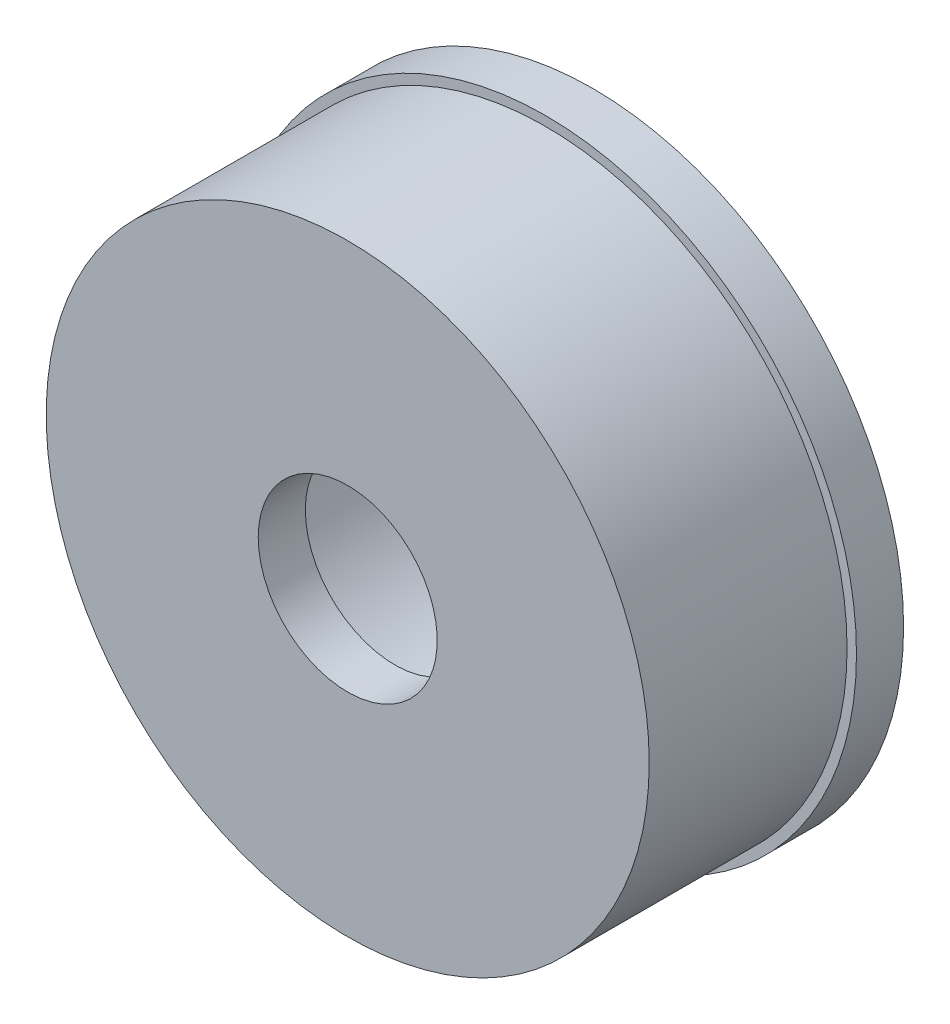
ISO-10303-21;
HEADER;
FILE_DESCRIPTION(('STEP AP214'),'2;1');
FILE_NAME('part.step','',(''),(''),'','','');
FILE_SCHEMA(('AUTOMOTIVE_DESIGN { 1 0 10303 214 1 1 1 1 }'));
ENDSEC;
DATA;
#1=APPLICATION_CONTEXT('core data for automotive mechanical design processes');
#2=APPLICATION_PROTOCOL_DEFINITION('international standard','automotive_design',2000,#1);
#3=PRODUCT_CONTEXT('',#1,'mechanical');
#4=PRODUCT('Part','Part','',(#3));
#5=PRODUCT_RELATED_PRODUCT_CATEGORY('part','',(#4));
#6=PRODUCT_DEFINITION_FORMATION('','',#4);
#7=PRODUCT_DEFINITION_CONTEXT('part definition',#1,'design');
#8=PRODUCT_DEFINITION('design','',#6,#7);
#9=PRODUCT_DEFINITION_SHAPE('','',#8);
#10=(LENGTH_UNIT() NAMED_UNIT(*) SI_UNIT(.MILLI.,.METRE.));
#11=(NAMED_UNIT(*) PLANE_ANGLE_UNIT() SI_UNIT($,.RADIAN.));
#12=(NAMED_UNIT(*) SI_UNIT($,.STERADIAN.) SOLID_ANGLE_UNIT());
#13=UNCERTAINTY_MEASURE_WITH_UNIT(LENGTH_MEASURE(1.E-05),#10,'distance_accuracy_value','');
#14=(GEOMETRIC_REPRESENTATION_CONTEXT(3) GLOBAL_UNCERTAINTY_ASSIGNED_CONTEXT((#13)) GLOBAL_UNIT_ASSIGNED_CONTEXT((#10,
#11,#12)) REPRESENTATION_CONTEXT('',''));
#15=CARTESIAN_POINT('',(0.,0.,0.));
#16=DIRECTION('',(0.,0.,1.));
#17=DIRECTION('',(1.,0.,0.));
#18=AXIS2_PLACEMENT_3D('',#15,#16,#17);
#19=CARTESIAN_POINT('',(0.,0.,26.));
#20=DIRECTION('',(0.,0.,-1.));
#21=DIRECTION('',(-1.,0.,0.));
#22=AXIS2_PLACEMENT_3D('',#19,#20,#21);
#23=CYLINDRICAL_SURFACE('',#22,33.);
#24=CARTESIAN_POINT('',(0.,0.,0.));
#25=DIRECTION('',(0.,0.,1.));
#26=DIRECTION('',(1.,0.,0.));
#27=AXIS2_PLACEMENT_3D('',#24,#25,#26);
#28=CIRCLE('',#27,33.);
#29=CARTESIAN_POINT('',(-33.,0.,0.));
#30=VERTEX_POINT('',#29);
#31=EDGE_CURVE('E11',#30,#30,#28,.T.);
#32=CARTESIAN_POINT('',(0.,0.,5.));
#33=DIRECTION('',(0.,0.,1.));
#34=DIRECTION('',(1.,0.,0.));
#35=AXIS2_PLACEMENT_3D('',#32,#33,#34);
#36=CIRCLE('',#35,33.);
#37=CARTESIAN_POINT('',(-33.,0.,5.));
#38=VERTEX_POINT('',#37);
#39=EDGE_CURVE('E38',#38,#38,#36,.T.);
#40=CARTESIAN_POINT('',(-33.,0.,0.));
#41=CARTESIAN_POINT('',(-33.,0.,0.0520833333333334));
#42=CARTESIAN_POINT('',(-33.,0.,0.104166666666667));
#43=CARTESIAN_POINT('',(-33.,0.,0.208333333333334));
#44=CARTESIAN_POINT('',(-33.,0.,0.260416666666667));
#45=CARTESIAN_POINT('',(-33.,0.,0.364583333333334));
#46=CARTESIAN_POINT('',(-33.,0.,0.416666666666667));
#47=CARTESIAN_POINT('',(-33.,0.,0.520833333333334));
#48=CARTESIAN_POINT('',(-33.,0.,0.572916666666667));
#49=CARTESIAN_POINT('',(-33.,0.,0.677083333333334));
#50=CARTESIAN_POINT('',(-33.,0.,0.729166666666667));
#51=CARTESIAN_POINT('',(-33.,0.,0.833333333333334));
#52=CARTESIAN_POINT('',(-33.,0.,0.885416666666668));
#53=CARTESIAN_POINT('',(-33.,0.,0.989583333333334));
#54=CARTESIAN_POINT('',(-33.,0.,1.04166666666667));
#55=CARTESIAN_POINT('',(-33.,0.,1.14583333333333));
#56=CARTESIAN_POINT('',(-33.,0.,1.19791666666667));
#57=CARTESIAN_POINT('',(-33.,0.,1.30208333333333));
#58=CARTESIAN_POINT('',(-33.,0.,1.35416666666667));
#59=CARTESIAN_POINT('',(-33.,0.,1.45833333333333));
#60=CARTESIAN_POINT('',(-33.,0.,1.51041666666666));
#61=CARTESIAN_POINT('',(-33.,0.,1.61458333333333));
#62=CARTESIAN_POINT('',(-33.,0.,1.66666666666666));
#63=CARTESIAN_POINT('',(-33.,0.,1.77083333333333));
#64=CARTESIAN_POINT('',(-33.,0.,1.82291666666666));
#65=CARTESIAN_POINT('',(-33.,0.,1.92708333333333));
#66=CARTESIAN_POINT('',(-33.,0.,1.97916666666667));
#67=CARTESIAN_POINT('',(-33.,0.,2.08333333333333));
#68=CARTESIAN_POINT('',(-33.,0.,2.13541666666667));
#69=CARTESIAN_POINT('',(-33.,0.,2.23958333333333));
#70=CARTESIAN_POINT('',(-33.,0.,2.29166666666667));
#71=CARTESIAN_POINT('',(-33.,0.,2.39583333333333));
#72=CARTESIAN_POINT('',(-33.,0.,2.44791666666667));
#73=CARTESIAN_POINT('',(-33.,0.,2.55208333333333));
#74=CARTESIAN_POINT('',(-33.,0.,2.60416666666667));
#75=CARTESIAN_POINT('',(-33.,0.,2.70833333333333));
#76=CARTESIAN_POINT('',(-33.,0.,2.76041666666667));
#77=CARTESIAN_POINT('',(-33.,0.,2.86458333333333));
#78=CARTESIAN_POINT('',(-33.,0.,2.91666666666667));
#79=CARTESIAN_POINT('',(-33.,0.,3.02083333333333));
#80=CARTESIAN_POINT('',(-33.,0.,3.07291666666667));
#81=CARTESIAN_POINT('',(-33.,0.,3.17708333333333));
#82=CARTESIAN_POINT('',(-33.,0.,3.22916666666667));
#83=CARTESIAN_POINT('',(-33.,0.,3.33333333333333));
#84=CARTESIAN_POINT('',(-33.,0.,3.38541666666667));
#85=CARTESIAN_POINT('',(-33.,0.,3.48958333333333));
#86=CARTESIAN_POINT('',(-33.,0.,3.54166666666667));
#87=CARTESIAN_POINT('',(-33.,0.,3.64583333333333));
#88=CARTESIAN_POINT('',(-33.,0.,3.69791666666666));
#89=CARTESIAN_POINT('',(-33.,0.,3.80208333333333));
#90=CARTESIAN_POINT('',(-33.,0.,3.85416666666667));
#91=CARTESIAN_POINT('',(-33.,0.,3.95833333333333));
#92=CARTESIAN_POINT('',(-33.,0.,4.01041666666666));
#93=CARTESIAN_POINT('',(-33.,0.,4.11458333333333));
#94=CARTESIAN_POINT('',(-33.,0.,4.16666666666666));
#95=CARTESIAN_POINT('',(-33.,0.,4.27083333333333));
#96=CARTESIAN_POINT('',(-33.,0.,4.32291666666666));
#97=CARTESIAN_POINT('',(-33.,0.,4.42708333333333));
#98=CARTESIAN_POINT('',(-33.,0.,4.47916666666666));
#99=CARTESIAN_POINT('',(-33.,0.,4.58333333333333));
#100=CARTESIAN_POINT('',(-33.,0.,4.63541666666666));
#101=CARTESIAN_POINT('',(-33.,0.,4.73958333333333));
#102=CARTESIAN_POINT('',(-33.,0.,4.79166666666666));
#103=CARTESIAN_POINT('',(-33.,0.,4.89583333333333));
#104=CARTESIAN_POINT('',(-33.,0.,4.94791666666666));
#105=CARTESIAN_POINT('',(-33.,0.,5.));
#106=B_SPLINE_CURVE_WITH_KNOTS('',3,(#40,#41,#42,#43,#44,#45,#46,#47,#48,#49,#50,#51,#52,#53,
#54,#55,#56,#57,#58,#59,#60,#61,#62,#63,#64,#65,#66,#67,#68,#69,#70,#71,#72,#73,#74,#75,#76,#77,
#78,#79,#80,#81,#82,#83,#84,#85,#86,#87,#88,#89,#90,#91,#92,#93,#94,#95,#96,#97,#98,#99,#100,
#101,#102,#103,#104,#105),.UNSPECIFIED.,.F.,.F.,(4,2,2,2,2,2,2,2,2,2,2,2,2,2,2,2,2,2,2,2,2,2,2,
2,2,2,2,2,2,2,2,2,4),(0.,0.15625,0.3125,0.46875,0.625000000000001,0.781250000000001,
0.937500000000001,1.09375,1.25,1.40625,1.5625,1.71875,1.875,2.03125,2.1875,2.34375,2.5,2.65625,
2.8125,2.96875,3.125,3.28125,3.4375,3.59375,3.75,3.90625,4.0625,4.21875,4.375,4.53125,4.6875,
4.84375,5.),.UNSPECIFIED.);
#107=EDGE_CURVE('BSEAM31',#30,#38,#106,.T.);
#108=ORIENTED_EDGE('',*,*,#31,.T.);
#109=ORIENTED_EDGE('',*,*,#39,.F.);
#110=ORIENTED_EDGE('',*,*,#107,.T.);
#111=ORIENTED_EDGE('',*,*,#107,.F.);
#112=EDGE_LOOP('',(#108,#110,#109,#111));
#113=FACE_BOUND('',#112,.T.);
#114=ADVANCED_FACE('F31',(#113),#23,.T.);
#115=CARTESIAN_POINT('',(0.,0.,0.));
#116=DIRECTION('',(0.,0.,1.));
#117=DIRECTION('',(1.,0.,0.));
#118=AXIS2_PLACEMENT_3D('',#115,#116,#117);
#119=PLANE('',#118);
#120=CARTESIAN_POINT('',(0.,0.,0.));
#121=DIRECTION('',(0.,0.,-1.));
#122=DIRECTION('',(-1.,0.,0.));
#123=AXIS2_PLACEMENT_3D('',#120,#121,#122);
#124=CIRCLE('',#123,24.5);
#125=CARTESIAN_POINT('',(-24.5,0.,0.));
#126=VERTEX_POINT('',#125);
#127=EDGE_CURVE('E110',#126,#126,#124,.T.);
#128=ORIENTED_EDGE('',*,*,#127,.F.);
#129=EDGE_LOOP('',(#128));
#130=FACE_BOUND('',#129,.T.);
#131=ORIENTED_EDGE('',*,*,#31,.F.);
#132=EDGE_LOOP('',(#131));
#133=FACE_BOUND('',#132,.T.);
#134=ADVANCED_FACE('F127',(#130,#133),#119,.F.);
#135=CARTESIAN_POINT('',(0.,0.,5.));
#136=DIRECTION('',(0.,0.,1.));
#137=DIRECTION('',(1.,0.,0.));
#138=AXIS2_PLACEMENT_3D('',#135,#136,#137);
#139=PLANE('',#138);
#140=CARTESIAN_POINT('',(0.,0.,5.));
#141=DIRECTION('',(0.,0.,1.));
#142=DIRECTION('',(1.,0.,0.));
#143=AXIS2_PLACEMENT_3D('',#140,#141,#142);
#144=CIRCLE('',#143,32.);
#145=CARTESIAN_POINT('',(32.,0.,5.));
#146=VERTEX_POINT('',#145);
#147=EDGE_CURVE('E119',#146,#146,#144,.T.);
#148=ORIENTED_EDGE('',*,*,#147,.F.);
#149=EDGE_LOOP('',(#148));
#150=FACE_BOUND('',#149,.T.);
#151=ORIENTED_EDGE('',*,*,#39,.T.);
#152=EDGE_LOOP('',(#151));
#153=FACE_BOUND('',#152,.T.);
#154=ADVANCED_FACE('F124',(#150,#153),#139,.T.);
#155=CARTESIAN_POINT('',(0.,0.,5.));
#156=DIRECTION('',(0.,0.,1.));
#157=DIRECTION('',(1.,0.,0.));
#158=AXIS2_PLACEMENT_3D('',#155,#156,#157);
#159=CYLINDRICAL_SURFACE('',#158,32.);
#160=CARTESIAN_POINT('',(0.,0.,26.));
#161=DIRECTION('',(0.,0.,1.));
#162=DIRECTION('',(1.,0.,0.));
#163=AXIS2_PLACEMENT_3D('',#160,#161,#162);
#164=CIRCLE('',#163,32.);
#165=CARTESIAN_POINT('',(32.,0.,26.));
#166=VERTEX_POINT('',#165);
#167=EDGE_CURVE('E116',#166,#166,#164,.T.);
#168=CARTESIAN_POINT('',(32.,0.,5.));
#169=CARTESIAN_POINT('',(32.,0.,5.21875));
#170=CARTESIAN_POINT('',(32.,0.,5.4375));
#171=CARTESIAN_POINT('',(32.,0.,5.875));
#172=CARTESIAN_POINT('',(32.,0.,6.09375));
#173=CARTESIAN_POINT('',(32.,0.,6.53125));
#174=CARTESIAN_POINT('',(32.,0.,6.75));
#175=CARTESIAN_POINT('',(32.,0.,7.1875));
#176=CARTESIAN_POINT('',(32.,0.,7.40625));
#177=CARTESIAN_POINT('',(32.,0.,7.84375));
#178=CARTESIAN_POINT('',(32.,0.,8.0625));
#179=CARTESIAN_POINT('',(32.,0.,8.5));
#180=CARTESIAN_POINT('',(32.,0.,8.71875));
#181=CARTESIAN_POINT('',(32.,0.,9.15625));
#182=CARTESIAN_POINT('',(32.,0.,9.375));
#183=CARTESIAN_POINT('',(32.,0.,9.8125));
#184=CARTESIAN_POINT('',(32.,0.,10.03125));
#185=CARTESIAN_POINT('',(32.,0.,10.46875));
#186=CARTESIAN_POINT('',(32.,0.,10.6875));
#187=CARTESIAN_POINT('',(32.,0.,11.125));
#188=CARTESIAN_POINT('',(32.,0.,11.34375));
#189=CARTESIAN_POINT('',(32.,0.,11.78125));
#190=CARTESIAN_POINT('',(32.,0.,12.));
#191=CARTESIAN_POINT('',(32.,0.,12.4375));
#192=CARTESIAN_POINT('',(32.,0.,12.65625));
#193=CARTESIAN_POINT('',(32.,0.,13.09375));
#194=CARTESIAN_POINT('',(32.,0.,13.3125));
#195=CARTESIAN_POINT('',(32.,0.,13.75));
#196=CARTESIAN_POINT('',(32.,0.,13.96875));
#197=CARTESIAN_POINT('',(32.,0.,14.40625));
#198=CARTESIAN_POINT('',(32.,0.,14.625));
#199=CARTESIAN_POINT('',(32.,0.,15.0625));
#200=CARTESIAN_POINT('',(32.,0.,15.28125));
#201=CARTESIAN_POINT('',(32.,0.,15.71875));
#202=CARTESIAN_POINT('',(32.,0.,15.9375));
#203=CARTESIAN_POINT('',(32.,0.,16.375));
#204=CARTESIAN_POINT('',(32.,0.,16.59375));
#205=CARTESIAN_POINT('',(32.,0.,17.03125));
#206=CARTESIAN_POINT('',(32.,0.,17.25));
#207=CARTESIAN_POINT('',(32.,0.,17.6875));
#208=CARTESIAN_POINT('',(32.,0.,17.90625));
#209=CARTESIAN_POINT('',(32.,0.,18.34375));
#210=CARTESIAN_POINT('',(32.,0.,18.5625));
#211=CARTESIAN_POINT('',(32.,0.,19.));
#212=CARTESIAN_POINT('',(32.,0.,19.21875));
#213=CARTESIAN_POINT('',(32.,0.,19.65625));
#214=CARTESIAN_POINT('',(32.,0.,19.875));
#215=CARTESIAN_POINT('',(32.,0.,20.3125));
#216=CARTESIAN_POINT('',(32.,0.,20.53125));
#217=CARTESIAN_POINT('',(32.,0.,20.96875));
#218=CARTESIAN_POINT('',(32.,0.,21.1875));
#219=CARTESIAN_POINT('',(32.,0.,21.625));
#220=CARTESIAN_POINT('',(32.,0.,21.84375));
#221=CARTESIAN_POINT('',(32.,0.,22.28125));
#222=CARTESIAN_POINT('',(32.,0.,22.5));
#223=CARTESIAN_POINT('',(32.,0.,22.9375));
#224=CARTESIAN_POINT('',(32.,0.,23.15625));
#225=CARTESIAN_POINT('',(32.,0.,23.59375));
#226=CARTESIAN_POINT('',(32.,0.,23.8125));
#227=CARTESIAN_POINT('',(32.,0.,24.25));
#228=CARTESIAN_POINT('',(32.,0.,24.46875));
#229=CARTESIAN_POINT('',(32.,0.,24.90625));
#230=CARTESIAN_POINT('',(32.,0.,25.125));
#231=CARTESIAN_POINT('',(32.,0.,25.5625));
#232=CARTESIAN_POINT('',(32.,0.,25.78125));
#233=CARTESIAN_POINT('',(32.,0.,26.));
#234=B_SPLINE_CURVE_WITH_KNOTS('',3,(#168,#169,#170,#171,#172,#173,#174,#175,#176,#177,#178,
#179,#180,#181,#182,#183,#184,#185,#186,#187,#188,#189,#190,#191,#192,#193,#194,#195,#196,#197,
#198,#199,#200,#201,#202,#203,#204,#205,#206,#207,#208,#209,#210,#211,#212,#213,#214,#215,#216,
#217,#218,#219,#220,#221,#222,#223,#224,#225,#226,#227,#228,#229,#230,#231,#232,#233),
.UNSPECIFIED.,.F.,.F.,(4,2,2,2,2,2,2,2,2,2,2,2,2,2,2,2,2,2,2,2,2,2,2,2,2,2,2,2,2,2,2,2,4),(0.,
0.656250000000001,1.3125,1.96875,2.625,3.28125,3.9375,4.59375,5.25,5.90625,6.5625,7.21875,7.875,
8.53125,9.1875,9.84375,10.5,11.15625,11.8125,12.46875,13.125,13.78125,14.4375,15.09375,15.75,
16.40625,17.0625,17.71875,18.375,19.03125,19.6875,20.34375,21.),.UNSPECIFIED.);
#235=EDGE_CURVE('BSEAM139',#146,#166,#234,.T.);
#236=ORIENTED_EDGE('',*,*,#147,.T.);
#237=ORIENTED_EDGE('',*,*,#167,.F.);
#238=ORIENTED_EDGE('',*,*,#235,.T.);
#239=ORIENTED_EDGE('',*,*,#235,.F.);
#240=EDGE_LOOP('',(#236,#238,#237,#239));
#241=FACE_BOUND('',#240,.T.);
#242=ADVANCED_FACE('F139',(#241),#159,.T.);
#243=CARTESIAN_POINT('',(0.,0.,26.));
#244=DIRECTION('',(0.,0.,1.));
#245=DIRECTION('',(1.,0.,0.));
#246=AXIS2_PLACEMENT_3D('',#243,#244,#245);
#247=PLANE('',#246);
#248=CARTESIAN_POINT('',(0.,0.,26.));
#249=DIRECTION('',(0.,0.,-1.));
#250=DIRECTION('',(-1.,0.,0.));
#251=AXIS2_PLACEMENT_3D('',#248,#249,#250);
#252=CIRCLE('',#251,9.5);
#253=CARTESIAN_POINT('',(-9.5,0.,26.));
#254=VERTEX_POINT('',#253);
#255=EDGE_CURVE('E95',#254,#254,#252,.T.);
#256=ORIENTED_EDGE('',*,*,#255,.T.);
#257=EDGE_LOOP('',(#256));
#258=FACE_BOUND('',#257,.T.);
#259=ORIENTED_EDGE('',*,*,#167,.T.);
#260=EDGE_LOOP('',(#259));
#261=FACE_BOUND('',#260,.T.);
#262=ADVANCED_FACE('F144',(#258,#261),#247,.T.);
#263=CARTESIAN_POINT('',(0.,0.,5.));
#264=DIRECTION('',(0.,0.,-1.));
#265=DIRECTION('',(-1.,0.,0.));
#266=AXIS2_PLACEMENT_3D('',#263,#264,#265);
#267=CYLINDRICAL_SURFACE('',#266,24.5);
#268=CARTESIAN_POINT('',(0.,0.,5.));
#269=DIRECTION('',(0.,0.,-1.));
#270=DIRECTION('',(-1.,0.,0.));
#271=AXIS2_PLACEMENT_3D('',#268,#269,#270);
#272=CIRCLE('',#271,24.5);
#273=CARTESIAN_POINT('',(-24.5,0.,5.));
#274=VERTEX_POINT('',#273);
#275=EDGE_CURVE('E113',#274,#274,#272,.T.);
#276=ORIENTED_EDGE('',*,*,#275,.F.);
#277=EDGE_LOOP('',(#276));
#278=FACE_BOUND('',#277,.T.);
#279=ORIENTED_EDGE('',*,*,#127,.T.);
#280=EDGE_LOOP('',(#279));
#281=FACE_BOUND('',#280,.T.);
#282=ADVANCED_FACE('F146',(#278,#281),#267,.F.);
#283=CARTESIAN_POINT('',(0.,0.,5.));
#284=DIRECTION('',(0.,0.,-1.));
#285=DIRECTION('',(-1.,0.,0.));
#286=AXIS2_PLACEMENT_3D('',#283,#284,#285);
#287=PLANE('',#286);
#288=CARTESIAN_POINT('',(-17.3205080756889,-9.99999999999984,5.));
#289=DIRECTION('',(0.,0.,-1.));
#290=DIRECTION('',(-1.,0.,0.));
#291=AXIS2_PLACEMENT_3D('',#288,#289,#290);
#292=CIRCLE('',#291,1.5);
#293=CARTESIAN_POINT('',(-18.8205080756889,-9.99999999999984,5.));
#294=VERTEX_POINT('',#293);
#295=EDGE_CURVE('E65',#294,#294,#292,.T.);
#296=ORIENTED_EDGE('',*,*,#295,.F.);
#297=EDGE_LOOP('',(#296));
#298=FACE_BOUND('',#297,.T.);
#299=CARTESIAN_POINT('',(17.3205080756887,-10.0000000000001,5.));
#300=DIRECTION('',(0.,0.,-1.));
#301=DIRECTION('',(-1.,0.,0.));
#302=AXIS2_PLACEMENT_3D('',#299,#300,#301);
#303=CIRCLE('',#302,1.5);
#304=CARTESIAN_POINT('',(15.8205080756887,-10.0000000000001,5.));
#305=VERTEX_POINT('',#304);
#306=EDGE_CURVE('E77',#305,#305,#303,.T.);
#307=ORIENTED_EDGE('',*,*,#306,.F.);
#308=EDGE_LOOP('',(#307));
#309=FACE_BOUND('',#308,.T.);
#310=CARTESIAN_POINT('',(0.,20.,5.));
#311=DIRECTION('',(0.,0.,-1.));
#312=DIRECTION('',(-1.,0.,0.));
#313=AXIS2_PLACEMENT_3D('',#310,#311,#312);
#314=CIRCLE('',#313,1.5);
#315=CARTESIAN_POINT('',(-1.5,20.,5.));
#316=VERTEX_POINT('',#315);
#317=EDGE_CURVE('E89',#316,#316,#314,.T.);
#318=ORIENTED_EDGE('',*,*,#317,.F.);
#319=EDGE_LOOP('',(#318));
#320=FACE_BOUND('',#319,.T.);
#321=CARTESIAN_POINT('',(0.,0.,5.));
#322=DIRECTION('',(0.,0.,-1.));
#323=DIRECTION('',(-1.,0.,0.));
#324=AXIS2_PLACEMENT_3D('',#321,#322,#323);
#325=CIRCLE('',#324,17.5);
#326=CARTESIAN_POINT('',(-17.5,0.,5.));
#327=VERTEX_POINT('',#326);
#328=EDGE_CURVE('E104',#327,#327,#325,.T.);
#329=ORIENTED_EDGE('',*,*,#328,.F.);
#330=EDGE_LOOP('',(#329));
#331=FACE_BOUND('',#330,.T.);
#332=ORIENTED_EDGE('',*,*,#275,.T.);
#333=EDGE_LOOP('',(#332));
#334=FACE_BOUND('',#333,.T.);
#335=ADVANCED_FACE('F152',(#298,#309,#320,#331,#334),#287,.T.);
#336=CARTESIAN_POINT('',(0.,0.,19.));
#337=DIRECTION('',(0.,0.,-1.));
#338=DIRECTION('',(-1.,0.,0.));
#339=AXIS2_PLACEMENT_3D('',#336,#337,#338);
#340=CYLINDRICAL_SURFACE('',#339,17.5);
#341=CARTESIAN_POINT('',(0.,0.,19.));
#342=DIRECTION('',(0.,0.,-1.));
#343=DIRECTION('',(-1.,0.,0.));
#344=AXIS2_PLACEMENT_3D('',#341,#342,#343);
#345=CIRCLE('',#344,17.5);
#346=CARTESIAN_POINT('',(-17.5,0.,19.));
#347=VERTEX_POINT('',#346);
#348=EDGE_CURVE('E107',#347,#347,#345,.T.);
#349=ORIENTED_EDGE('',*,*,#348,.F.);
#350=EDGE_LOOP('',(#349));
#351=FACE_BOUND('',#350,.T.);
#352=ORIENTED_EDGE('',*,*,#328,.T.);
#353=EDGE_LOOP('',(#352));
#354=FACE_BOUND('',#353,.T.);
#355=ADVANCED_FACE('F183',(#351,#354),#340,.F.);
#356=CARTESIAN_POINT('',(0.,0.,19.));
#357=DIRECTION('',(0.,0.,-1.));
#358=DIRECTION('',(-1.,0.,0.));
#359=AXIS2_PLACEMENT_3D('',#356,#357,#358);
#360=PLANE('',#359);
#361=CARTESIAN_POINT('',(0.,0.,19.));
#362=DIRECTION('',(0.,0.,-1.));
#363=DIRECTION('',(-1.,0.,0.));
#364=AXIS2_PLACEMENT_3D('',#361,#362,#363);
#365=CIRCLE('',#364,16.5);
#366=CARTESIAN_POINT('',(-16.5,0.,19.));
#367=VERTEX_POINT('',#366);
#368=EDGE_CURVE('E98',#367,#367,#365,.T.);
#369=ORIENTED_EDGE('',*,*,#368,.F.);
#370=EDGE_LOOP('',(#369));
#371=FACE_BOUND('',#370,.T.);
#372=ORIENTED_EDGE('',*,*,#348,.T.);
#373=EDGE_LOOP('',(#372));
#374=FACE_BOUND('',#373,.T.);
#375=ADVANCED_FACE('F177',(#371,#374),#360,.T.);
#376=CARTESIAN_POINT('',(0.,0.,21.));
#377=DIRECTION('',(0.,0.,-1.));
#378=DIRECTION('',(-1.,0.,0.));
#379=AXIS2_PLACEMENT_3D('',#376,#377,#378);
#380=CYLINDRICAL_SURFACE('',#379,16.5);
#381=CARTESIAN_POINT('',(0.,0.,21.));
#382=DIRECTION('',(0.,0.,-1.));
#383=DIRECTION('',(-1.,0.,0.));
#384=AXIS2_PLACEMENT_3D('',#381,#382,#383);
#385=CIRCLE('',#384,16.5);
#386=CARTESIAN_POINT('',(-16.5,0.,21.));
#387=VERTEX_POINT('',#386);
#388=EDGE_CURVE('E101',#387,#387,#385,.T.);
#389=ORIENTED_EDGE('',*,*,#388,.F.);
#390=EDGE_LOOP('',(#389));
#391=FACE_BOUND('',#390,.T.);
#392=ORIENTED_EDGE('',*,*,#368,.T.);
#393=EDGE_LOOP('',(#392));
#394=FACE_BOUND('',#393,.T.);
#395=ADVANCED_FACE('F171',(#391,#394),#380,.F.);
#396=CARTESIAN_POINT('',(0.,0.,21.));
#397=DIRECTION('',(0.,0.,-1.));
#398=DIRECTION('',(-1.,0.,0.));
#399=AXIS2_PLACEMENT_3D('',#396,#397,#398);
#400=PLANE('',#399);
#401=CARTESIAN_POINT('',(0.,0.,21.));
#402=DIRECTION('',(0.,0.,-1.));
#403=DIRECTION('',(-1.,0.,0.));
#404=AXIS2_PLACEMENT_3D('',#401,#402,#403);
#405=CIRCLE('',#404,9.5);
#406=CARTESIAN_POINT('',(-9.5,0.,21.));
#407=VERTEX_POINT('',#406);
#408=EDGE_CURVE('E92',#407,#407,#405,.T.);
#409=ORIENTED_EDGE('',*,*,#408,.F.);
#410=EDGE_LOOP('',(#409));
#411=FACE_BOUND('',#410,.T.);
#412=ORIENTED_EDGE('',*,*,#388,.T.);
#413=EDGE_LOOP('',(#412));
#414=FACE_BOUND('',#413,.T.);
#415=ADVANCED_FACE('F165',(#411,#414),#400,.T.);
#416=CARTESIAN_POINT('',(0.,0.,26.));
#417=DIRECTION('',(0.,0.,-1.));
#418=DIRECTION('',(-1.,0.,0.));
#419=AXIS2_PLACEMENT_3D('',#416,#417,#418);
#420=CYLINDRICAL_SURFACE('',#419,9.5);
#421=ORIENTED_EDGE('',*,*,#255,.F.);
#422=EDGE_LOOP('',(#421));
#423=FACE_BOUND('',#422,.T.);
#424=ORIENTED_EDGE('',*,*,#408,.T.);
#425=EDGE_LOOP('',(#424));
#426=FACE_BOUND('',#425,.T.);
#427=ADVANCED_FACE('F161',(#423,#426),#420,.F.);
#428=CARTESIAN_POINT('',(0.,20.,5.));
#429=DIRECTION('',(0.,0.,-1.));
#430=DIRECTION('',(-1.,0.,0.));
#431=AXIS2_PLACEMENT_3D('',#428,#429,#430);
#432=CYLINDRICAL_SURFACE('',#431,1.5);
#433=CARTESIAN_POINT('',(0.,20.,12.));
#434=DIRECTION('',(0.,0.,-1.));
#435=DIRECTION('',(-1.,0.,0.));
#436=AXIS2_PLACEMENT_3D('',#433,#434,#435);
#437=CIRCLE('',#436,1.5);
#438=CARTESIAN_POINT('',(-1.5,20.,12.));
#439=VERTEX_POINT('',#438);
#440=EDGE_CURVE('E86',#439,#439,#437,.T.);
#441=ORIENTED_EDGE('',*,*,#440,.F.);
#442=EDGE_LOOP('',(#441));
#443=FACE_BOUND('',#442,.T.);
#444=ORIENTED_EDGE('',*,*,#317,.T.);
#445=EDGE_LOOP('',(#444));
#446=FACE_BOUND('',#445,.T.);
#447=ADVANCED_FACE('F164',(#443,#446),#432,.F.);
#448=CARTESIAN_POINT('',(1.25,20.,12.));
#449=DIRECTION('',(0.,0.,1.));
#450=DIRECTION('',(1.,0.,0.));
#451=AXIS2_PLACEMENT_3D('',#448,#449,#450);
#452=PLANE('',#451);
#453=CARTESIAN_POINT('',(0.,20.,12.));
#454=DIRECTION('',(0.,0.,-1.));
#455=DIRECTION('',(-1.,0.,0.));
#456=AXIS2_PLACEMENT_3D('',#453,#454,#455);
#457=CIRCLE('',#456,1.25);
#458=CARTESIAN_POINT('',(-1.25,20.,12.));
#459=VERTEX_POINT('',#458);
#460=EDGE_CURVE('E83',#459,#459,#457,.T.);
#461=ORIENTED_EDGE('',*,*,#460,.F.);
#462=EDGE_LOOP('',(#461));
#463=FACE_BOUND('',#462,.T.);
#464=ORIENTED_EDGE('',*,*,#440,.T.);
#465=EDGE_LOOP('',(#464));
#466=FACE_BOUND('',#465,.T.);
#467=ADVANCED_FACE('F205',(#463,#466),#452,.F.);
#468=CARTESIAN_POINT('',(0.,20.,5.));
#469=DIRECTION('',(0.,0.,-1.));
#470=DIRECTION('',(-1.,0.,0.));
#471=AXIS2_PLACEMENT_3D('',#468,#469,#470);
#472=CYLINDRICAL_SURFACE('',#471,1.25);
#473=CARTESIAN_POINT('',(0.,20.,15.));
#474=DIRECTION('',(0.,0.,-1.));
#475=DIRECTION('',(-1.,0.,0.));
#476=AXIS2_PLACEMENT_3D('',#473,#474,#475);
#477=CIRCLE('',#476,1.25);
#478=CARTESIAN_POINT('',(-1.25,20.,15.));
#479=VERTEX_POINT('',#478);
#480=EDGE_CURVE('E80',#479,#479,#477,.T.);
#481=ORIENTED_EDGE('',*,*,#480,.F.);
#482=EDGE_LOOP('',(#481));
#483=FACE_BOUND('',#482,.T.);
#484=ORIENTED_EDGE('',*,*,#460,.T.);
#485=EDGE_LOOP('',(#484));
#486=FACE_BOUND('',#485,.T.);
#487=ADVANCED_FACE('F209',(#483,#486),#472,.F.);
#488=CARTESIAN_POINT('',(0.,20.,15.));
#489=DIRECTION('',(0.,0.,-1.));
#490=DIRECTION('',(-1.,0.,0.));
#491=AXIS2_PLACEMENT_3D('',#488,#489,#490);
#492=CONICAL_SURFACE('',#491,1.25,1.02974425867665);
#493=CARTESIAN_POINT('',(0.,20.,15.7510757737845));
#494=VERTEX_POINT('',#493);
#495=VERTEX_LOOP('',#494);
#496=FACE_BOUND('',#495,.T.);
#497=ORIENTED_EDGE('',*,*,#480,.T.);
#498=EDGE_LOOP('',(#497));
#499=FACE_BOUND('',#498,.T.);
#500=ADVANCED_FACE('F213',(#496,#499),#492,.F.);
#501=CARTESIAN_POINT('',(17.3205080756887,-10.0000000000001,5.));
#502=DIRECTION('',(0.,0.,-1.));
#503=DIRECTION('',(-1.,0.,0.));
#504=AXIS2_PLACEMENT_3D('',#501,#502,#503);
#505=CYLINDRICAL_SURFACE('',#504,1.5);
#506=CARTESIAN_POINT('',(17.3205080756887,-10.0000000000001,12.));
#507=DIRECTION('',(0.,0.,-1.));
#508=DIRECTION('',(-1.,0.,0.));
#509=AXIS2_PLACEMENT_3D('',#506,#507,#508);
#510=CIRCLE('',#509,1.5);
#511=CARTESIAN_POINT('',(15.8205080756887,-10.0000000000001,12.));
#512=VERTEX_POINT('',#511);
#513=EDGE_CURVE('E74',#512,#512,#510,.T.);
#514=ORIENTED_EDGE('',*,*,#513,.F.);
#515=EDGE_LOOP('',(#514));
#516=FACE_BOUND('',#515,.T.);
#517=ORIENTED_EDGE('',*,*,#306,.T.);
#518=EDGE_LOOP('',(#517));
#519=FACE_BOUND('',#518,.T.);
#520=ADVANCED_FACE('F217',(#516,#519),#505,.F.);
#521=CARTESIAN_POINT('',(18.5705080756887,-10.0000000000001,12.));
#522=DIRECTION('',(0.,0.,1.));
#523=DIRECTION('',(1.,0.,0.));
#524=AXIS2_PLACEMENT_3D('',#521,#522,#523);
#525=PLANE('',#524);
#526=CARTESIAN_POINT('',(17.3205080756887,-10.0000000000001,12.));
#527=DIRECTION('',(0.,0.,-1.));
#528=DIRECTION('',(-1.,0.,0.));
#529=AXIS2_PLACEMENT_3D('',#526,#527,#528);
#530=CIRCLE('',#529,1.25);
#531=CARTESIAN_POINT('',(16.0705080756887,-10.0000000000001,12.));
#532=VERTEX_POINT('',#531);
#533=EDGE_CURVE('E71',#532,#532,#530,.T.);
#534=ORIENTED_EDGE('',*,*,#533,.F.);
#535=EDGE_LOOP('',(#534));
#536=FACE_BOUND('',#535,.T.);
#537=ORIENTED_EDGE('',*,*,#513,.T.);
#538=EDGE_LOOP('',(#537));
#539=FACE_BOUND('',#538,.T.);
#540=ADVANCED_FACE('F220',(#536,#539),#525,.F.);
#541=CARTESIAN_POINT('',(17.3205080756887,-10.0000000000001,5.));
#542=DIRECTION('',(0.,0.,-1.));
#543=DIRECTION('',(-1.,0.,0.));
#544=AXIS2_PLACEMENT_3D('',#541,#542,#543);
#545=CYLINDRICAL_SURFACE('',#544,1.25);
#546=CARTESIAN_POINT('',(17.3205080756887,-10.0000000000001,15.));
#547=DIRECTION('',(0.,0.,-1.));
#548=DIRECTION('',(-1.,0.,0.));
#549=AXIS2_PLACEMENT_3D('',#546,#547,#548);
#550=CIRCLE('',#549,1.25);
#551=CARTESIAN_POINT('',(16.0705080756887,-10.0000000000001,15.));
#552=VERTEX_POINT('',#551);
#553=EDGE_CURVE('E68',#552,#552,#550,.T.);
#554=ORIENTED_EDGE('',*,*,#553,.F.);
#555=EDGE_LOOP('',(#554));
#556=FACE_BOUND('',#555,.T.);
#557=ORIENTED_EDGE('',*,*,#533,.T.);
#558=EDGE_LOOP('',(#557));
#559=FACE_BOUND('',#558,.T.);
#560=ADVANCED_FACE('F224',(#556,#559),#545,.F.);
#561=CARTESIAN_POINT('',(17.3205080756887,-10.0000000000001,15.));
#562=DIRECTION('',(0.,0.,-1.));
#563=DIRECTION('',(-1.,0.,0.));
#564=AXIS2_PLACEMENT_3D('',#561,#562,#563);
#565=CONICAL_SURFACE('',#564,1.25,1.02974425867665);
#566=CARTESIAN_POINT('',(17.3205080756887,-10.0000000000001,15.7510757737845));
#567=VERTEX_POINT('',#566);
#568=VERTEX_LOOP('',#567);
#569=FACE_BOUND('',#568,.T.);
#570=ORIENTED_EDGE('',*,*,#553,.T.);
#571=EDGE_LOOP('',(#570));
#572=FACE_BOUND('',#571,.T.);
#573=ADVANCED_FACE('F228',(#569,#572),#565,.F.);
#574=CARTESIAN_POINT('',(-17.3205080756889,-9.99999999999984,5.));
#575=DIRECTION('',(0.,0.,-1.));
#576=DIRECTION('',(-1.,0.,0.));
#577=AXIS2_PLACEMENT_3D('',#574,#575,#576);
#578=CYLINDRICAL_SURFACE('',#577,1.5);
#579=CARTESIAN_POINT('',(-17.3205080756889,-9.99999999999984,12.));
#580=DIRECTION('',(0.,0.,-1.));
#581=DIRECTION('',(-1.,0.,0.));
#582=AXIS2_PLACEMENT_3D('',#579,#580,#581);
#583=CIRCLE('',#582,1.5);
#584=CARTESIAN_POINT('',(-18.8205080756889,-9.99999999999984,12.));
#585=VERTEX_POINT('',#584);
#586=EDGE_CURVE('E60',#585,#585,#583,.T.);
#587=ORIENTED_EDGE('',*,*,#586,.F.);
#588=EDGE_LOOP('',(#587));
#589=FACE_BOUND('',#588,.T.);
#590=ORIENTED_EDGE('',*,*,#295,.T.);
#591=EDGE_LOOP('',(#590));
#592=FACE_BOUND('',#591,.T.);
#593=ADVANCED_FACE('F232',(#589,#592),#578,.F.);
#594=CARTESIAN_POINT('',(-16.0705080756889,-9.99999999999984,12.));
#595=DIRECTION('',(0.,0.,1.));
#596=DIRECTION('',(1.,0.,0.));
#597=AXIS2_PLACEMENT_3D('',#594,#595,#596);
#598=PLANE('',#597);
#599=CARTESIAN_POINT('',(-17.3205080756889,-9.99999999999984,12.));
#600=DIRECTION('',(0.,0.,-1.));
#601=DIRECTION('',(-1.,0.,0.));
#602=AXIS2_PLACEMENT_3D('',#599,#600,#601);
#603=CIRCLE('',#602,1.25);
#604=CARTESIAN_POINT('',(-18.5705080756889,-9.99999999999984,12.));
#605=VERTEX_POINT('',#604);
#606=EDGE_CURVE('E57',#605,#605,#603,.T.);
#607=ORIENTED_EDGE('',*,*,#606,.F.);
#608=EDGE_LOOP('',(#607));
#609=FACE_BOUND('',#608,.T.);
#610=ORIENTED_EDGE('',*,*,#586,.T.);
#611=EDGE_LOOP('',(#610));
#612=FACE_BOUND('',#611,.T.);
#613=ADVANCED_FACE('F235',(#609,#612),#598,.F.);
#614=CARTESIAN_POINT('',(-17.3205080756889,-9.99999999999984,5.));
#615=DIRECTION('',(0.,0.,-1.));
#616=DIRECTION('',(-1.,0.,0.));
#617=AXIS2_PLACEMENT_3D('',#614,#615,#616);
#618=CYLINDRICAL_SURFACE('',#617,1.25);
#619=CARTESIAN_POINT('',(-17.3205080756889,-9.99999999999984,15.));
#620=DIRECTION('',(0.,0.,-1.));
#621=DIRECTION('',(-1.,0.,0.));
#622=AXIS2_PLACEMENT_3D('',#619,#620,#621);
#623=CIRCLE('',#622,1.25);
#624=CARTESIAN_POINT('',(-18.5705080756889,-9.99999999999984,15.));
#625=VERTEX_POINT('',#624);
#626=EDGE_CURVE('E55',#625,#625,#623,.T.);
#627=ORIENTED_EDGE('',*,*,#626,.F.);
#628=EDGE_LOOP('',(#627));
#629=FACE_BOUND('',#628,.T.);
#630=ORIENTED_EDGE('',*,*,#606,.T.);
#631=EDGE_LOOP('',(#630));
#632=FACE_BOUND('',#631,.T.);
#633=ADVANCED_FACE('F51',(#629,#632),#618,.F.);
#634=CARTESIAN_POINT('',(-17.3205080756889,-9.99999999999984,15.));
#635=DIRECTION('',(0.,0.,-1.));
#636=DIRECTION('',(-1.,0.,0.));
#637=AXIS2_PLACEMENT_3D('',#634,#635,#636);
#638=CONICAL_SURFACE('',#637,1.25,1.02974425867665);
#639=CARTESIAN_POINT('',(-17.3205080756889,-9.99999999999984,15.7510757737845));
#640=VERTEX_POINT('',#639);
#641=VERTEX_LOOP('',#640);
#642=FACE_BOUND('',#641,.T.);
#643=ORIENTED_EDGE('',*,*,#626,.T.);
#644=EDGE_LOOP('',(#643));
#645=FACE_BOUND('',#644,.T.);
#646=ADVANCED_FACE('F48',(#642,#645),#638,.F.);
#647=CLOSED_SHELL('',(#114,#134,#154,#242,#262,#282,#335,#355,#375,#395,#415,#427,#447,#467,
#487,#500,#520,#540,#560,#573,#593,#613,#633,#646));
#648=MANIFOLD_SOLID_BREP('B2',#647);
#649=ADVANCED_BREP_SHAPE_REPRESENTATION('',(#18,#648),#14);
#650=SHAPE_DEFINITION_REPRESENTATION(#9,#649);
ENDSEC;
END-ISO-10303-21;
